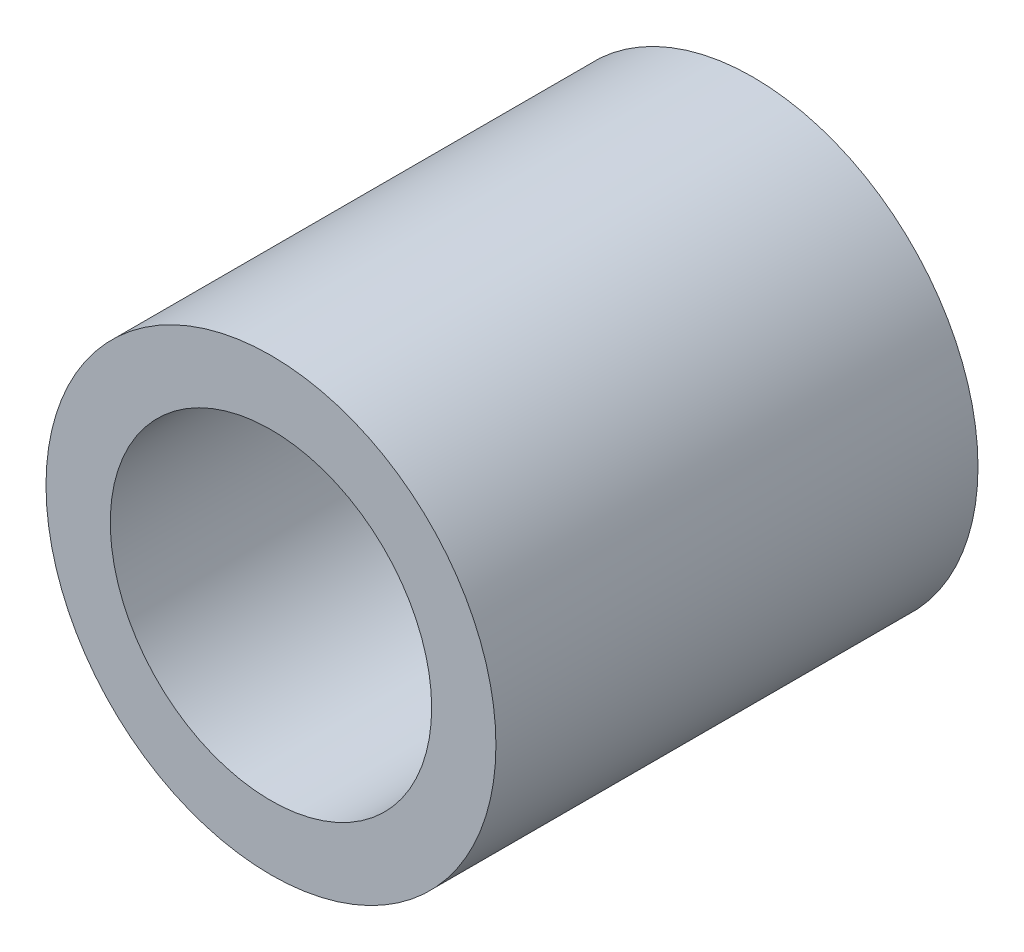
ISO-10303-21;
HEADER;
FILE_DESCRIPTION(('STEP AP214'),'2;1');
FILE_NAME('part.step','',(''),(''),'','','');
FILE_SCHEMA(('AUTOMOTIVE_DESIGN { 1 0 10303 214 1 1 1 1 }'));
ENDSEC;
DATA;
#1=APPLICATION_CONTEXT('core data for automotive mechanical design processes');
#2=APPLICATION_PROTOCOL_DEFINITION('international standard','automotive_design',2000,#1);
#3=PRODUCT_CONTEXT('',#1,'mechanical');
#4=PRODUCT('Part','Part','',(#3));
#5=PRODUCT_RELATED_PRODUCT_CATEGORY('part','',(#4));
#6=PRODUCT_DEFINITION_FORMATION('','',#4);
#7=PRODUCT_DEFINITION_CONTEXT('part definition',#1,'design');
#8=PRODUCT_DEFINITION('design','',#6,#7);
#9=PRODUCT_DEFINITION_SHAPE('','',#8);
#10=(LENGTH_UNIT() NAMED_UNIT(*) SI_UNIT(.MILLI.,.METRE.));
#11=(NAMED_UNIT(*) PLANE_ANGLE_UNIT() SI_UNIT($,.RADIAN.));
#12=(NAMED_UNIT(*) SI_UNIT($,.STERADIAN.) SOLID_ANGLE_UNIT());
#13=UNCERTAINTY_MEASURE_WITH_UNIT(LENGTH_MEASURE(1.E-05),#10,'distance_accuracy_value','');
#14=(GEOMETRIC_REPRESENTATION_CONTEXT(3) GLOBAL_UNCERTAINTY_ASSIGNED_CONTEXT((#13)) GLOBAL_UNIT_ASSIGNED_CONTEXT((#10,
#11,#12)) REPRESENTATION_CONTEXT('',''));
#15=CARTESIAN_POINT('',(0.,0.,0.));
#16=DIRECTION('',(0.,0.,1.));
#17=DIRECTION('',(1.,0.,0.));
#18=AXIS2_PLACEMENT_3D('',#15,#16,#17);
#19=CARTESIAN_POINT('',(0.,0.,15.));
#20=DIRECTION('',(0.,0.,1.));
#21=DIRECTION('',(1.,0.,0.));
#22=AXIS2_PLACEMENT_3D('',#19,#20,#21);
#23=PLANE('',#22);
#24=CARTESIAN_POINT('',(0.,0.,15.));
#25=DIRECTION('',(0.,0.,1.));
#26=DIRECTION('',(1.,0.,0.));
#27=AXIS2_PLACEMENT_3D('',#24,#25,#26);
#28=CIRCLE('',#27,7.);
#29=CARTESIAN_POINT('',(7.,0.,15.));
#30=VERTEX_POINT('',#29);
#31=EDGE_CURVE('E10',#30,#30,#28,.T.);
#32=ORIENTED_EDGE('',*,*,#31,.T.);
#33=EDGE_LOOP('',(#32));
#34=FACE_BOUND('',#33,.T.);
#35=CARTESIAN_POINT('',(0.,0.,15.));
#36=DIRECTION('',(0.,0.,1.));
#37=DIRECTION('',(1.,0.,0.));
#38=AXIS2_PLACEMENT_3D('',#35,#36,#37);
#39=CIRCLE('',#38,5.);
#40=CARTESIAN_POINT('',(5.,0.,15.));
#41=VERTEX_POINT('',#40);
#42=EDGE_CURVE('E357',#41,#41,#39,.T.);
#43=ORIENTED_EDGE('',*,*,#42,.F.);
#44=EDGE_LOOP('',(#43));
#45=FACE_BOUND('',#44,.T.);
#46=ADVANCED_FACE('F346',(#34,#45),#23,.T.);
#47=CARTESIAN_POINT('',(0.,0.,0.));
#48=DIRECTION('',(0.,0.,1.));
#49=DIRECTION('',(1.,0.,0.));
#50=AXIS2_PLACEMENT_3D('',#47,#48,#49);
#51=PLANE('',#50);
#52=CARTESIAN_POINT('',(0.,0.,0.));
#53=DIRECTION('',(0.,0.,1.));
#54=DIRECTION('',(1.,0.,0.));
#55=AXIS2_PLACEMENT_3D('',#52,#53,#54);
#56=CIRCLE('',#55,7.);
#57=CARTESIAN_POINT('',(7.,0.,0.));
#58=VERTEX_POINT('',#57);
#59=EDGE_CURVE('E353',#58,#58,#56,.T.);
#60=ORIENTED_EDGE('',*,*,#59,.F.);
#61=EDGE_LOOP('',(#60));
#62=FACE_BOUND('',#61,.T.);
#63=CARTESIAN_POINT('',(0.,0.,0.));
#64=DIRECTION('',(0.,0.,1.));
#65=DIRECTION('',(1.,0.,0.));
#66=AXIS2_PLACEMENT_3D('',#63,#64,#65);
#67=CIRCLE('',#66,5.);
#68=CARTESIAN_POINT('',(5.,0.,0.));
#69=VERTEX_POINT('',#68);
#70=EDGE_CURVE('E361',#69,#69,#67,.T.);
#71=ORIENTED_EDGE('',*,*,#70,.T.);
#72=EDGE_LOOP('',(#71));
#73=FACE_BOUND('',#72,.T.);
#74=ADVANCED_FACE('F367',(#62,#73),#51,.F.);
#75=CARTESIAN_POINT('',(0.,0.,15.));
#76=DIRECTION('',(0.,0.,-1.));
#77=DIRECTION('',(-1.,0.,0.));
#78=AXIS2_PLACEMENT_3D('',#75,#76,#77);
#79=CYLINDRICAL_SURFACE('',#78,7.);
#80=ORIENTED_EDGE('',*,*,#31,.F.);
#81=EDGE_LOOP('',(#80));
#82=FACE_BOUND('',#81,.T.);
#83=ORIENTED_EDGE('',*,*,#59,.T.);
#84=EDGE_LOOP('',(#83));
#85=FACE_BOUND('',#84,.T.);
#86=ADVANCED_FACE('F348',(#82,#85),#79,.T.);
#87=CARTESIAN_POINT('',(0.,0.,15.));
#88=DIRECTION('',(0.,0.,-1.));
#89=DIRECTION('',(-1.,0.,0.));
#90=AXIS2_PLACEMENT_3D('',#87,#88,#89);
#91=CYLINDRICAL_SURFACE('',#90,5.);
#92=ORIENTED_EDGE('',*,*,#42,.T.);
#93=EDGE_LOOP('',(#92));
#94=FACE_BOUND('',#93,.T.);
#95=ORIENTED_EDGE('',*,*,#70,.F.);
#96=EDGE_LOOP('',(#95));
#97=FACE_BOUND('',#96,.T.);
#98=ADVANCED_FACE('F369',(#94,#97),#91,.F.);
#99=CLOSED_SHELL('',(#46,#74,#86,#98));
#100=MANIFOLD_SOLID_BREP('B2',#99);
#101=ADVANCED_BREP_SHAPE_REPRESENTATION('',(#18,#100),#14);
#102=SHAPE_DEFINITION_REPRESENTATION(#9,#101);
ENDSEC;
END-ISO-10303-21;
